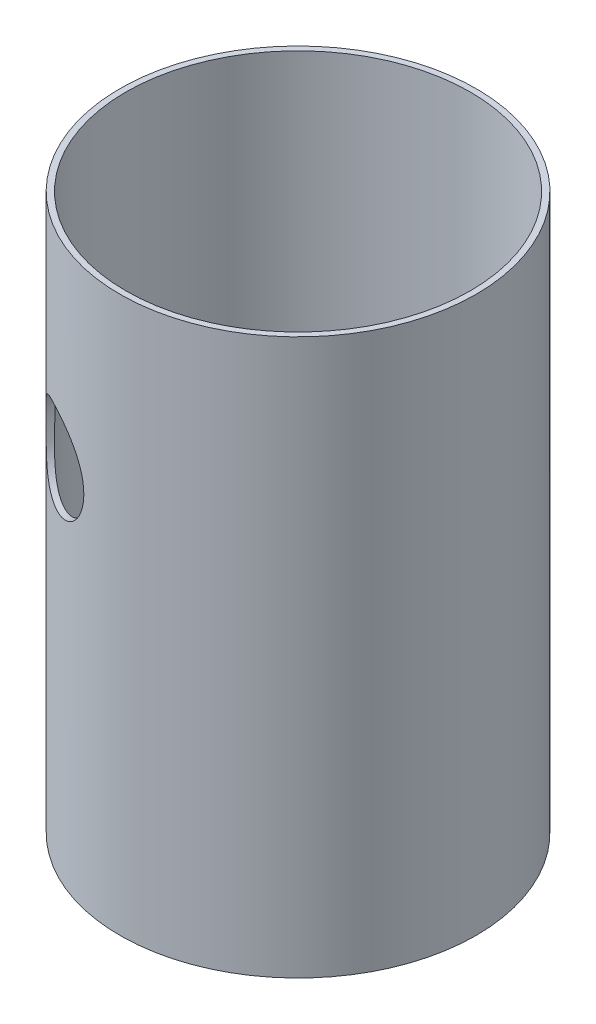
from build123d import *

# Parameters (mm, degrees)
LINEAR_AUSTRAGEN_D_NN1_DEPTH         = 233
LINEAR_AUSTRAGEN_D_NN1_DEPTH_BACK    = 427
SKIZZE3_R                            = 211.703590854
SKIZZE3_R_2                          = 204.703590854
SCHNITT_LINEAR_AUSTRAGEN1_REACH      = 759.775
SCHNITT_LINEAR_AUSTRAGEN1_END_RADIUS = 204.703590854
SKIZZE1_R                            = 52


with BuildPart() as part:
    # Skizze3 → Linear-Austragen-D_nn1 (new, two sides: drawn at the far end of the back side and taken through both)
    with BuildSketch(Plane(origin=(0, 0, 0), x_dir=(1, 0, 0), z_dir=(0, 1, 0)).offset(-LINEAR_AUSTRAGEN_D_NN1_DEPTH_BACK)):
        with Locations((100.573445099, 330.861402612)):
            Circle(SKIZZE3_R)
        with Locations((100.573445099, 330.861402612)):
            Circle(SKIZZE3_R_2, mode=Mode.SUBTRACT)
    extrude(amount=LINEAR_AUSTRAGEN_D_NN1_DEPTH + LINEAR_AUSTRAGEN_D_NN1_DEPTH_BACK)

    # Schnitt-Linear austragen1: up to this cylinder (the profile starts outside it)
    schnitt_linear_austragen1_end = Plane(origin=(100.573445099, 0, -330.861402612), z_dir=(0, 1, 0)) * Cylinder(SCHNITT_LINEAR_AUSTRAGEN1_END_RADIUS, 1929.957181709, mode=Mode.PRIVATE)
    # Skizze1 → Schnitt-Linear austragen1 (cut, up to the surface)
    with BuildSketch(Plane.XY, mode=Mode.PRIVATE) as schnitt_linear_austragen1_sk1:
        Circle(SKIZZE1_R)
    schnitt_linear_austragen1_tool1 = extrude(schnitt_linear_austragen1_sk1.sketch, amount=-SCHNITT_LINEAR_AUSTRAGEN1_REACH, mode=Mode.PRIVATE) - schnitt_linear_austragen1_end
    add(schnitt_linear_austragen1_tool1.solids().sort_by_distance((0, 0, 0))[0], mode=Mode.SUBTRACT)


solid = part.part
